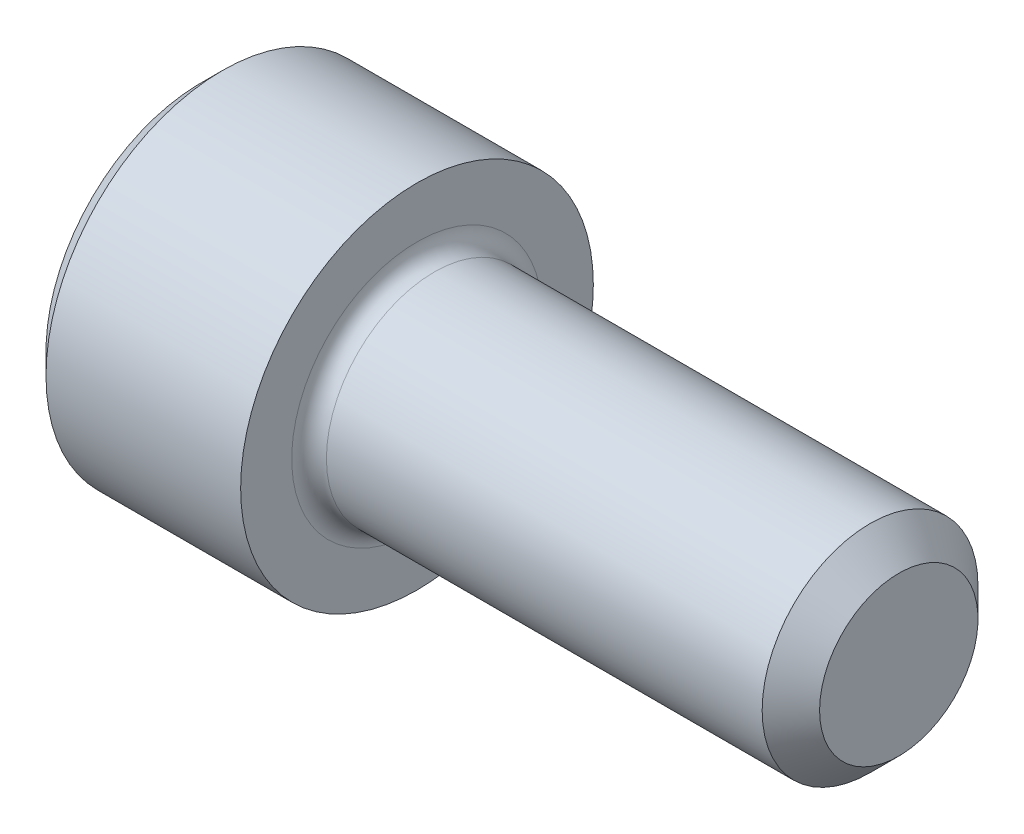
from build123d import *

# Parameters (mm, degrees)
FILLET1_R   = 0.2286
HEX_2_DEPTH = 1.2954


with BuildPart() as part:
    # BodySke → Base-Revolve (revolve)
    with BuildSketch(Plane.XY, mode=Mode.PRIVATE) as base_revolve_sk:
        Polygon((0, 0), (0, 2.0447), (0.2794, 2.3241), (2.8448, 2.3241), (2.8448, 1.4224), (8.81634, 1.4224), (9.1948, 1.04394), (9.1948, 0), align=None)
    revolve(base_revolve_sk.sketch.rotate(Axis((-31.75, 0, 0), (1, 0, 0)), 90), axis=Axis((-31.75, 0, 0), (1, 0, 0)))

    # Fillet1
    fillet1_edges = [part.edges().sort_by_distance(p)[0] for p in [
        (2.8448, 0, -1.4224),
    ]]
    fillet(fillet1_edges, radius=FILLET1_R)

    # Sketch2 → Hex-PreBroach (revolve, cut)
    with BuildSketch(Plane.XY, mode=Mode.PRIVATE) as hex_prebroach_sk:
        Polygon((0, 1.1938), (1.2954, 1.1938), (1.984640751, 0), (0, 0), align=None)
    revolve(hex_prebroach_sk.sketch.rotate(Axis((0, 0, 0), (1, 0, 0)), 90), axis=Axis((0, 0, 0), (1, 0, 0)), mode=Mode.SUBTRACT)

    # Sketch3 → Hex 2 (cut)
    with BuildSketch(Plane(origin=(0, 0, 0), x_dir=(0, 0.500000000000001, 0.866025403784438), z_dir=(-1, 0, 0))):
        Polygon((0.689240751, 1.1938), (-0.689240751, 1.1938), (-1.378481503, 0), (-0.689240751, -1.1938), (0.689240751, -1.1938), (1.378481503, 0), align=None)
    extrude(amount=-HEX_2_DEPTH, mode=Mode.SUBTRACT)


solid = part.part
